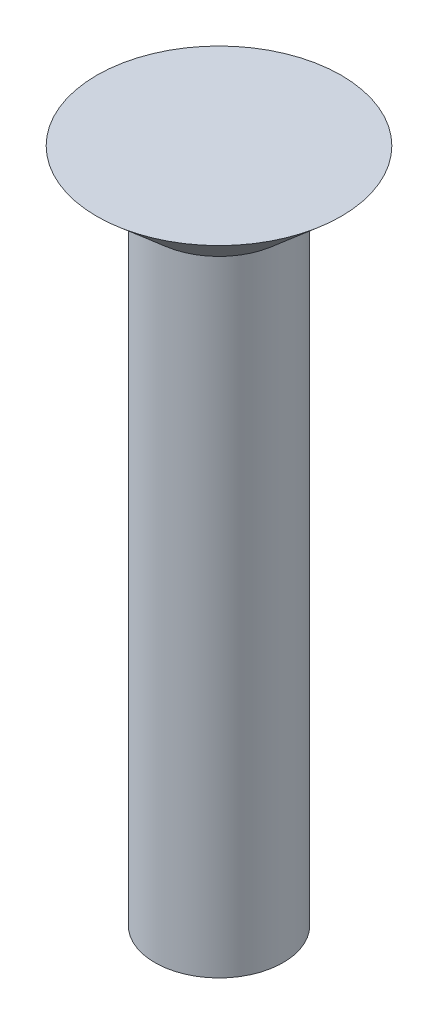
ISO-10303-21;
HEADER;
FILE_DESCRIPTION(('STEP AP214'),'2;1');
FILE_NAME('part.step','',(''),(''),'','','');
FILE_SCHEMA(('AUTOMOTIVE_DESIGN { 1 0 10303 214 1 1 1 1 }'));
ENDSEC;
DATA;
#1=APPLICATION_CONTEXT('core data for automotive mechanical design processes');
#2=APPLICATION_PROTOCOL_DEFINITION('international standard','automotive_design',2000,#1);
#3=PRODUCT_CONTEXT('',#1,'mechanical');
#4=PRODUCT('Part','Part','',(#3));
#5=PRODUCT_RELATED_PRODUCT_CATEGORY('part','',(#4));
#6=PRODUCT_DEFINITION_FORMATION('','',#4);
#7=PRODUCT_DEFINITION_CONTEXT('part definition',#1,'design');
#8=PRODUCT_DEFINITION('design','',#6,#7);
#9=PRODUCT_DEFINITION_SHAPE('','',#8);
#10=(LENGTH_UNIT() NAMED_UNIT(*) SI_UNIT(.MILLI.,.METRE.));
#11=(NAMED_UNIT(*) PLANE_ANGLE_UNIT() SI_UNIT($,.RADIAN.));
#12=(NAMED_UNIT(*) SI_UNIT($,.STERADIAN.) SOLID_ANGLE_UNIT());
#13=UNCERTAINTY_MEASURE_WITH_UNIT(LENGTH_MEASURE(1.E-05),#10,'distance_accuracy_value','');
#14=(GEOMETRIC_REPRESENTATION_CONTEXT(3) GLOBAL_UNCERTAINTY_ASSIGNED_CONTEXT((#13)) GLOBAL_UNIT_ASSIGNED_CONTEXT((#10,
#11,#12)) REPRESENTATION_CONTEXT('',''));
#15=CARTESIAN_POINT('',(0.,0.,0.));
#16=DIRECTION('',(0.,0.,1.));
#17=DIRECTION('',(1.,0.,0.));
#18=AXIS2_PLACEMENT_3D('',#15,#16,#17);
#19=CARTESIAN_POINT('',(0.,0.,0.));
#20=DIRECTION('',(0.,-1.,0.));
#21=DIRECTION('',(1.,0.,0.));
#22=AXIS2_PLACEMENT_3D('',#19,#20,#21);
#23=PLANE('',#22);
#24=CARTESIAN_POINT('',(0.,0.,0.));
#25=DIRECTION('',(0.,1.,0.));
#26=DIRECTION('',(-1.,0.,0.));
#27=AXIS2_PLACEMENT_3D('',#24,#25,#26);
#28=CIRCLE('',#27,4.5974);
#29=CARTESIAN_POINT('',(-4.5974,0.,0.));
#30=VERTEX_POINT('',#29);
#31=EDGE_CURVE('E10',#30,#30,#28,.T.);
#32=ORIENTED_EDGE('',*,*,#31,.T.);
#33=EDGE_LOOP('',(#32));
#34=FACE_BOUND('',#33,.T.);
#35=ADVANCED_FACE('F31',(#34),#23,.F.);
#36=CARTESIAN_POINT('',(0.,-1.89886995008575,0.));
#37=DIRECTION('',(0.,1.,0.));
#38=DIRECTION('',(-1.,0.,0.));
#39=AXIS2_PLACEMENT_3D('',#36,#37,#38);
#40=CONICAL_SURFACE('',#39,2.413,0.855211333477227);
#41=ORIENTED_EDGE('',*,*,#31,.F.);
#42=EDGE_LOOP('',(#41));
#43=FACE_BOUND('',#42,.T.);
#44=CARTESIAN_POINT('',(0.,-1.89886995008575,0.));
#45=DIRECTION('',(0.,1.,0.));
#46=DIRECTION('',(-1.,0.,0.));
#47=AXIS2_PLACEMENT_3D('',#44,#45,#46);
#48=CIRCLE('',#47,2.413);
#49=CARTESIAN_POINT('',(-2.413,-1.89886995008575,0.));
#50=VERTEX_POINT('',#49);
#51=EDGE_CURVE('E37',#50,#50,#48,.T.);
#52=ORIENTED_EDGE('',*,*,#51,.T.);
#53=EDGE_LOOP('',(#52));
#54=FACE_BOUND('',#53,.T.);
#55=ADVANCED_FACE('F56',(#43,#54),#40,.T.);
#56=CARTESIAN_POINT('',(0.,0.,0.));
#57=DIRECTION('',(0.,1.,0.));
#58=DIRECTION('',(-1.,0.,0.));
#59=AXIS2_PLACEMENT_3D('',#56,#57,#58);
#60=CYLINDRICAL_SURFACE('',#59,2.413);
#61=ORIENTED_EDGE('',*,*,#51,.F.);
#62=EDGE_LOOP('',(#61));
#63=FACE_BOUND('',#62,.T.);
#64=CARTESIAN_POINT('',(0.,-25.4,0.));
#65=DIRECTION('',(0.,1.,0.));
#66=DIRECTION('',(-1.,0.,0.));
#67=AXIS2_PLACEMENT_3D('',#64,#65,#66);
#68=CIRCLE('',#67,2.413);
#69=CARTESIAN_POINT('',(-2.413,-25.4,0.));
#70=VERTEX_POINT('',#69);
#71=EDGE_CURVE('E41',#70,#70,#68,.T.);
#72=ORIENTED_EDGE('',*,*,#71,.T.);
#73=EDGE_LOOP('',(#72));
#74=FACE_BOUND('',#73,.T.);
#75=ADVANCED_FACE('F48',(#63,#74),#60,.T.);
#76=CARTESIAN_POINT('',(2.413,-25.4,0.));
#77=DIRECTION('',(0.,1.,0.));
#78=DIRECTION('',(-1.,0.,0.));
#79=AXIS2_PLACEMENT_3D('',#76,#77,#78);
#80=PLANE('',#79);
#81=ORIENTED_EDGE('',*,*,#71,.F.);
#82=EDGE_LOOP('',(#81));
#83=FACE_BOUND('',#82,.T.);
#84=ADVANCED_FACE('F50',(#83),#80,.F.);
#85=CLOSED_SHELL('',(#35,#55,#75,#84));
#86=MANIFOLD_SOLID_BREP('B2',#85);
#87=ADVANCED_BREP_SHAPE_REPRESENTATION('',(#18,#86),#14);
#88=SHAPE_DEFINITION_REPRESENTATION(#9,#87);
ENDSEC;
END-ISO-10303-21;
